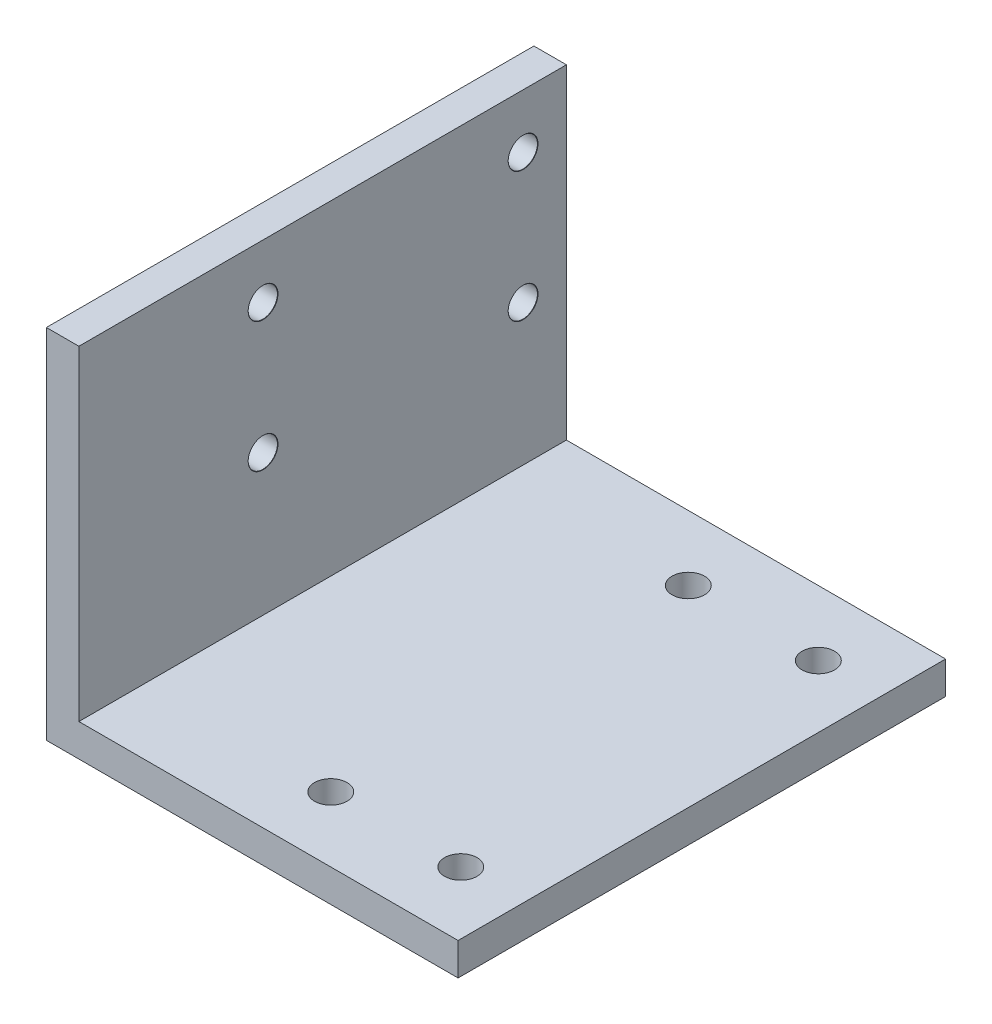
from build123d import *

# Parameters (mm, degrees)
SKETCH1_W                        = 38
SKETCH1_H                        = 45
SKETCH1_R                        = 1.5
BOSS_EXTRUDE1_DEPTH              = 3
SKETCH2_W                        = 3
SKETCH2_H                        = 45
BOSS_EXTRUDE2_DEPTH              = 30
M2_5_CLEARANCE_HOLE1_D           = 2.7
M2_5_CLEARANCE_HOLE1_DEPTH       = 5.538838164
M2_5_CLEARANCE_HOLE1_CSINK_D     = 2.75
M2_5_CLEARANCE_HOLE1_CSINK_ANGLE = 90
M2_5_CLEARANCE_HOLE1_TIP         = 0.811161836


with BuildPart() as part:
    # Sketch1 → Boss-Extrude1 (new body)
    with BuildSketch(Plane(origin=(0, 0, 0), x_dir=(1, 0, 0), z_dir=(0, 1, 0))):
        Rectangle(SKETCH1_W, SKETCH1_H)
        with Locations(Location((13.25, 16.5, 0), (0, 0, 270))):
            Circle(SKETCH1_R, mode=Mode.SUBTRACT)
        with Locations(Location((1.25, 16.5, 0), (0, 0, 270))):
            Circle(SKETCH1_R, mode=Mode.SUBTRACT)
        with Locations(Location((13.25, -16.5, 0), (0, 0, 90))):
            Circle(SKETCH1_R, mode=Mode.SUBTRACT)
        with Locations(Location((1.25, -16.5, 0), (0, 0, 90))):
            Circle(SKETCH1_R, mode=Mode.SUBTRACT)
    extrude(amount=BOSS_EXTRUDE1_DEPTH)

    # Sketch2 → Boss-Extrude2 (add)
    with BuildSketch(Plane(origin=(0, 3, 0), x_dir=(1, 0, 0), z_dir=(0, 1, 0))):
        with Locations((-17.5, 0)):
            Rectangle(SKETCH2_W, SKETCH2_H)
    extrude(amount=BOSS_EXTRUDE2_DEPTH)

    # M2.5 Clearance Hole1
    with Locations(Plane(origin=(-16, 0, 0), x_dir=(0, 0, -1), z_dir=(1, 0, 0))):
        with Locations((18.5, 28), (18.5, 16), (-5.5, 28), (-5.5, 16)):
            CounterSinkHole(M2_5_CLEARANCE_HOLE1_D / 2, M2_5_CLEARANCE_HOLE1_CSINK_D / 2, depth=M2_5_CLEARANCE_HOLE1_DEPTH, counter_sink_angle=M2_5_CLEARANCE_HOLE1_CSINK_ANGLE)
            with Locations((0, 0, -(M2_5_CLEARANCE_HOLE1_DEPTH + M2_5_CLEARANCE_HOLE1_TIP / 2))):  # 118° drill point
                Cone(0, M2_5_CLEARANCE_HOLE1_D / 2, M2_5_CLEARANCE_HOLE1_TIP, mode=Mode.SUBTRACT)


solid = part.part
